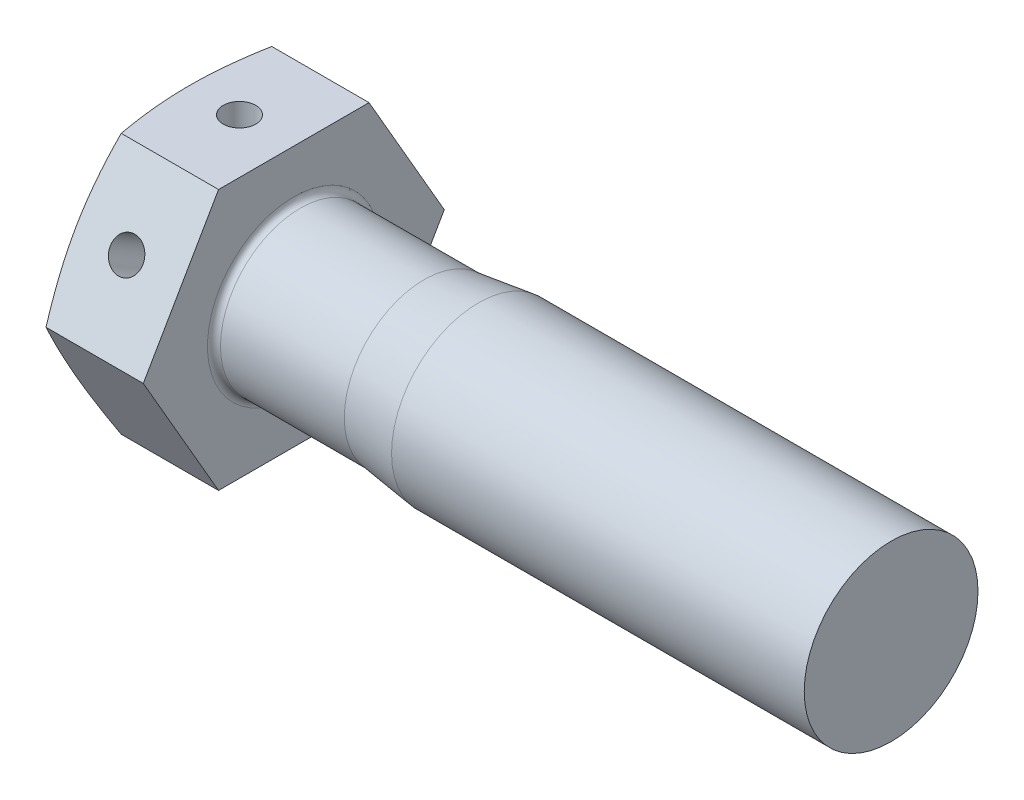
from build123d import *

# Parameters (mm, degrees)
BASEHEAD_DEPTH     = 10
SKETCH2_R          = 8
BASEBODY_DEPTH     = 55
SKETCH4_R          = 8.85
CUT_EXTRUDE1_DEPTH = 2
HEADFILLET_R       = 0.6
SKETCH6_R          = 1.5
HOLE_DEPTH         = 68.53517602
CIRPATTERN1_COUNT  = 2
CIRPATTERN1_ANGLE  = 60


with BuildPart() as part:
    # Sketch1 → BaseHead (new body)
    with BuildSketch(Plane(origin=(0, 0, 0), x_dir=(0, 0, -1), z_dir=(1, 0, 0))):
        Polygon((13.856406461, 0), (6.92820323, 12), (-6.92820323, 12), (-13.856406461, 0), (-6.92820323, -12), (6.92820323, -12), align=None)
    extrude(amount=BASEHEAD_DEPTH)

    # Sketch2 → BaseBody (add)
    with BuildSketch(Plane(origin=(10, 0, 0), x_dir=(0, 0, -1), z_dir=(1, 0, 0))):
        Circle(SKETCH2_R)
    extrude(amount=BASEBODY_DEPTH)

    # Sketch3 → HeadChamfer (revolve, cut)
    with BuildSketch(Plane(origin=(3.161211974, 0, 2.612290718), x_dir=(0, 0, -1), z_dir=(0, 1, 0)), mode=Mode.PRIVATE) as headchamfer_sk:
        Polygon((16.468697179, 3.161211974), (16.468697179, 2.121565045), (13.612290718, 3.161211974), align=None)
    revolve(headchamfer_sk.sketch.rotate(Axis((-2.071354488, 0, 0), (1, 0, 0)), 180), axis=Axis((-2.071354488, 0, 0), (1, 0, 0)), mode=Mode.SUBTRACT)

    # Sketch4 → Cut-Extrude1 (cut)
    with BuildSketch(Plane.ZY):
        Circle(SKETCH4_R)
    extrude(amount=-CUT_EXTRUDE1_DEPTH, mode=Mode.SUBTRACT)

    # Sketch5 → Cut-Revolve1 (revolve, cut)
    with BuildSketch(Plane(origin=(-2.92963122, 0, 7.92963122), x_dir=(0, 0, -1), z_dir=(0, 1, 0)), mode=Mode.PRIVATE) as cut_revolve1_sk:
        Polygon((15.92963122, -29.92963122), (15.28013122, -24.92963122), (15.28013122, -12.92963122), (22.63063122, -12.92963122), (22.63063122, -29.92963122), align=None)
    revolve(cut_revolve1_sk.sketch.rotate(Axis((-2.697175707, 0, 0), (1, 0, 0)), 180), axis=Axis((-2.697175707, 0, 0), (1, 0, 0)), mode=Mode.SUBTRACT)

    # HeadFillet
    headfillet_edges = [part.edges().sort_by_distance(p)[0] for p in [
        (10, 0, -7.3505),
    ]]
    fillet(headfillet_edges, radius=HEADFILLET_R)

    # Sketch6 → Hole (cut, symmetric)
    with BuildSketch(Plane(origin=(0, 0, 0), x_dir=(1, 0, 0), z_dir=(0, 1, 0))):
        with Locations(Location((5, 0, 0), (0, 0, 270))):
            Circle(SKETCH6_R)
    hole = extrude(amount=HOLE_DEPTH, both=True, mode=Mode.SUBTRACT)

    # CirPattern1: Hole ×2 about axis
    cirpattern1_axis = Axis((-2.697175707, 0, 0), (1, 0, 0))
    for i in range(1, CIRPATTERN1_COUNT):
        add(hole.rotate(cirpattern1_axis, i * CIRPATTERN1_ANGLE / (CIRPATTERN1_COUNT - 1)), mode=Mode.SUBTRACT)


solid = part.part
